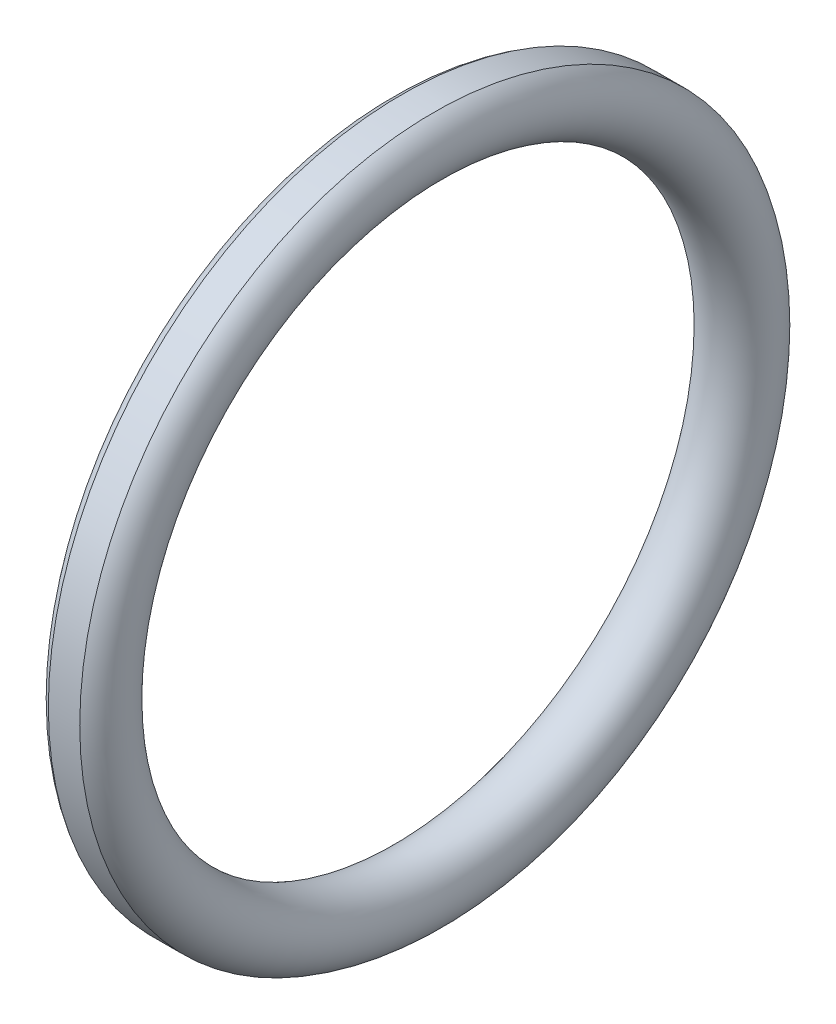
ISO-10303-21;
HEADER;
FILE_DESCRIPTION(('STEP AP214'),'2;1');
FILE_NAME('part.step','',(''),(''),'','','');
FILE_SCHEMA(('AUTOMOTIVE_DESIGN { 1 0 10303 214 1 1 1 1 }'));
ENDSEC;
DATA;
#1=APPLICATION_CONTEXT('core data for automotive mechanical design processes');
#2=APPLICATION_PROTOCOL_DEFINITION('international standard','automotive_design',2000,#1);
#3=PRODUCT_CONTEXT('',#1,'mechanical');
#4=PRODUCT('Part','Part','',(#3));
#5=PRODUCT_RELATED_PRODUCT_CATEGORY('part','',(#4));
#6=PRODUCT_DEFINITION_FORMATION('','',#4);
#7=PRODUCT_DEFINITION_CONTEXT('part definition',#1,'design');
#8=PRODUCT_DEFINITION('design','',#6,#7);
#9=PRODUCT_DEFINITION_SHAPE('','',#8);
#10=(LENGTH_UNIT() NAMED_UNIT(*) SI_UNIT(.MILLI.,.METRE.));
#11=(NAMED_UNIT(*) PLANE_ANGLE_UNIT() SI_UNIT($,.RADIAN.));
#12=(NAMED_UNIT(*) SI_UNIT($,.STERADIAN.) SOLID_ANGLE_UNIT());
#13=UNCERTAINTY_MEASURE_WITH_UNIT(LENGTH_MEASURE(1.E-05),#10,'distance_accuracy_value','');
#14=(GEOMETRIC_REPRESENTATION_CONTEXT(3) GLOBAL_UNCERTAINTY_ASSIGNED_CONTEXT((#13)) GLOBAL_UNIT_ASSIGNED_CONTEXT((#10,
#11,#12)) REPRESENTATION_CONTEXT('',''));
#15=CARTESIAN_POINT('',(0.,0.,0.));
#16=DIRECTION('',(0.,0.,1.));
#17=DIRECTION('',(1.,0.,0.));
#18=AXIS2_PLACEMENT_3D('',#15,#16,#17);
#19=CARTESIAN_POINT('',(0.,0.,0.));
#20=DIRECTION('',(-1.,0.,0.));
#21=DIRECTION('',(0.,0.,1.));
#22=AXIS2_PLACEMENT_3D('',#19,#20,#21);
#23=TOROIDAL_SURFACE('',#22,16.75,1.75);
#24=CARTESIAN_POINT('',(0.812403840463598,0.,0.));
#25=DIRECTION('',(-1.,0.,0.));
#26=DIRECTION('',(0.,0.,1.));
#27=AXIS2_PLACEMENT_3D('',#24,#25,#26);
#28=CIRCLE('',#27,18.3);
#29=CARTESIAN_POINT('',(0.812403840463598,0.,18.3));
#30=VERTEX_POINT('',#29);
#31=EDGE_CURVE('E64',#30,#30,#28,.T.);
#32=ORIENTED_EDGE('',*,*,#31,.F.);
#33=EDGE_LOOP('',(#32));
#34=FACE_BOUND('',#33,.T.);
#35=CARTESIAN_POINT('',(-0.812403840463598,0.,0.));
#36=DIRECTION('',(1.,0.,0.));
#37=DIRECTION('',(0.,0.,-1.));
#38=AXIS2_PLACEMENT_3D('',#35,#36,#37);
#39=CIRCLE('',#38,18.3);
#40=CARTESIAN_POINT('',(-0.812403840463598,0.,-18.3));
#41=VERTEX_POINT('',#40);
#42=EDGE_CURVE('E10',#41,#41,#39,.T.);
#43=ORIENTED_EDGE('',*,*,#42,.F.);
#44=EDGE_LOOP('',(#43));
#45=FACE_BOUND('',#44,.T.);
#46=ADVANCED_FACE('F58',(#34,#45),#23,.T.);
#47=CARTESIAN_POINT('',(-3.70745536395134,0.,0.));
#48=DIRECTION('',(-1.,0.,0.));
#49=DIRECTION('',(0.,0.,1.));
#50=AXIS2_PLACEMENT_3D('',#47,#48,#49);
#51=CYLINDRICAL_SURFACE('',#50,18.3);
#52=ORIENTED_EDGE('',*,*,#31,.T.);
#53=EDGE_LOOP('',(#52));
#54=FACE_BOUND('',#53,.T.);
#55=ORIENTED_EDGE('',*,*,#42,.T.);
#56=EDGE_LOOP('',(#55));
#57=FACE_BOUND('',#56,.T.);
#58=ADVANCED_FACE('F70',(#54,#57),#51,.T.);
#59=CLOSED_SHELL('',(#46,#58));
#60=MANIFOLD_SOLID_BREP('B2',#59);
#61=ADVANCED_BREP_SHAPE_REPRESENTATION('',(#18,#60),#14);
#62=SHAPE_DEFINITION_REPRESENTATION(#9,#61);
ENDSEC;
END-ISO-10303-21;
